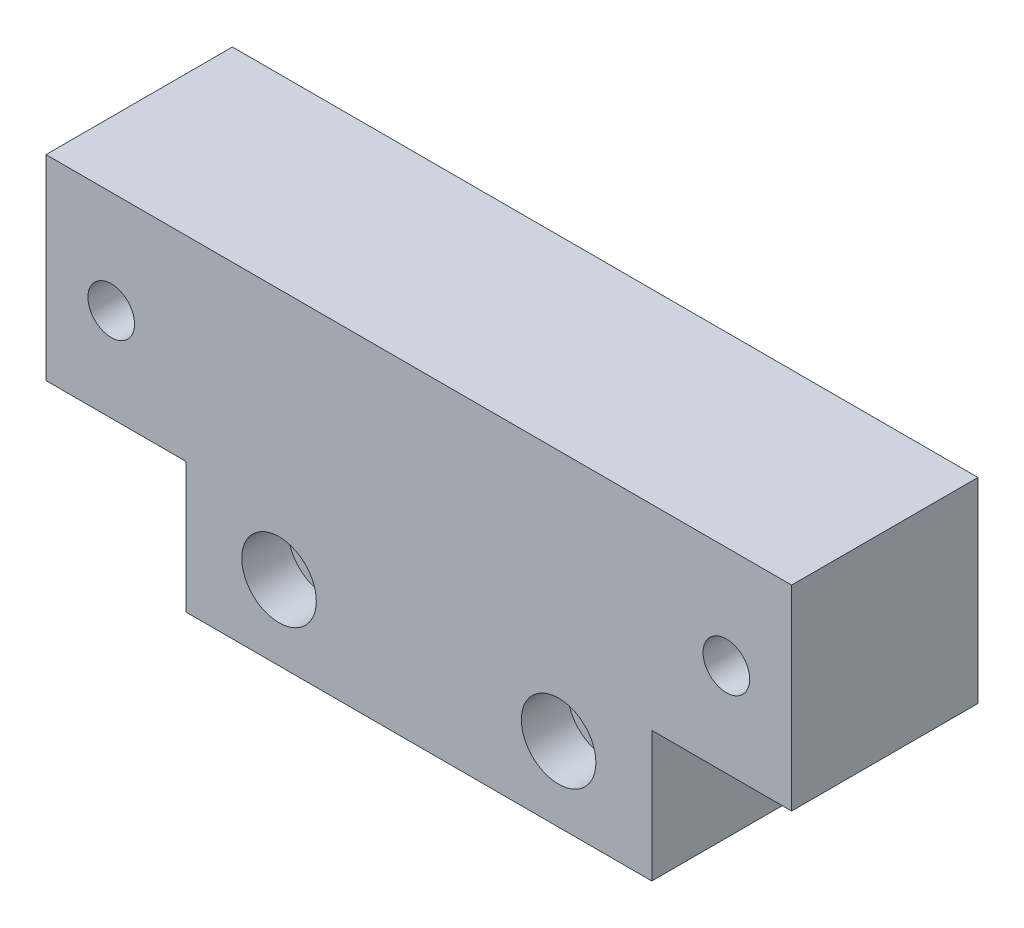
ISO-10303-21;
HEADER;
FILE_DESCRIPTION(('STEP AP214'),'2;1');
FILE_NAME('part.step','',(''),(''),'','','');
FILE_SCHEMA(('AUTOMOTIVE_DESIGN { 1 0 10303 214 1 1 1 1 }'));
ENDSEC;
DATA;
#1=APPLICATION_CONTEXT('core data for automotive mechanical design processes');
#2=APPLICATION_PROTOCOL_DEFINITION('international standard','automotive_design',2000,#1);
#3=PRODUCT_CONTEXT('',#1,'mechanical');
#4=PRODUCT('Part','Part','',(#3));
#5=PRODUCT_RELATED_PRODUCT_CATEGORY('part','',(#4));
#6=PRODUCT_DEFINITION_FORMATION('','',#4);
#7=PRODUCT_DEFINITION_CONTEXT('part definition',#1,'design');
#8=PRODUCT_DEFINITION('design','',#6,#7);
#9=PRODUCT_DEFINITION_SHAPE('','',#8);
#10=(LENGTH_UNIT() NAMED_UNIT(*) SI_UNIT(.MILLI.,.METRE.));
#11=(NAMED_UNIT(*) PLANE_ANGLE_UNIT() SI_UNIT($,.RADIAN.));
#12=(NAMED_UNIT(*) SI_UNIT($,.STERADIAN.) SOLID_ANGLE_UNIT());
#13=UNCERTAINTY_MEASURE_WITH_UNIT(LENGTH_MEASURE(1.E-05),#10,'distance_accuracy_value','');
#14=(GEOMETRIC_REPRESENTATION_CONTEXT(3) GLOBAL_UNCERTAINTY_ASSIGNED_CONTEXT((#13)) GLOBAL_UNIT_ASSIGNED_CONTEXT((#10,
#11,#12)) REPRESENTATION_CONTEXT('',''));
#15=CARTESIAN_POINT('',(0.,0.,0.));
#16=DIRECTION('',(0.,0.,1.));
#17=DIRECTION('',(1.,0.,0.));
#18=AXIS2_PLACEMENT_3D('',#15,#16,#17);
#19=CARTESIAN_POINT('',(40.,-3.49999999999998,20.));
#20=DIRECTION('',(-1.,0.,0.));
#21=DIRECTION('',(0.,0.,1.));
#22=AXIS2_PLACEMENT_3D('',#19,#20,#21);
#23=PLANE('',#22);
#24=DIRECTION('',(0.,1.,0.));
#25=VECTOR('',#24,1.);
#26=CARTESIAN_POINT('',(40.,-3.49999999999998,0.));
#27=LINE('',#26,#25);
#28=CARTESIAN_POINT('',(40.,-3.49999999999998,0.));
#29=VERTEX_POINT('',#28);
#30=CARTESIAN_POINT('',(40.,17.5,0.));
#31=VERTEX_POINT('',#30);
#32=EDGE_CURVE('E141',#29,#31,#27,.T.);
#33=ORIENTED_EDGE('',*,*,#32,.T.);
#34=DIRECTION('',(0.,0.,-1.));
#35=VECTOR('',#34,1.);
#36=CARTESIAN_POINT('',(40.,17.5,20.));
#37=LINE('',#36,#35);
#38=CARTESIAN_POINT('',(40.,17.5,20.));
#39=VERTEX_POINT('',#38);
#40=EDGE_CURVE('E11',#39,#31,#37,.T.);
#41=ORIENTED_EDGE('',*,*,#40,.F.);
#42=DIRECTION('',(0.,1.,0.));
#43=VECTOR('',#42,1.);
#44=CARTESIAN_POINT('',(40.,-3.49999999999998,20.));
#45=LINE('',#44,#43);
#46=CARTESIAN_POINT('',(40.,-3.49999999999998,20.));
#47=VERTEX_POINT('',#46);
#48=EDGE_CURVE('E156',#47,#39,#45,.T.);
#49=ORIENTED_EDGE('',*,*,#48,.F.);
#50=DIRECTION('',(0.,0.,-1.));
#51=VECTOR('',#50,1.);
#52=CARTESIAN_POINT('',(40.,-3.49999999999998,20.));
#53=LINE('',#52,#51);
#54=EDGE_CURVE('E137',#47,#29,#53,.T.);
#55=ORIENTED_EDGE('',*,*,#54,.T.);
#56=EDGE_LOOP('',(#33,#41,#49,#55));
#57=FACE_BOUND('',#56,.T.);
#58=ADVANCED_FACE('F43',(#57),#23,.F.);
#59=CARTESIAN_POINT('',(-40.,17.5,20.));
#60=DIRECTION('',(0.,-1.,0.));
#61=DIRECTION('',(0.,0.,-1.));
#62=AXIS2_PLACEMENT_3D('',#59,#60,#61);
#63=PLANE('',#62);
#64=DIRECTION('',(-1.,0.,0.));
#65=VECTOR('',#64,1.);
#66=CARTESIAN_POINT('',(-40.,17.5,0.));
#67=LINE('',#66,#65);
#68=CARTESIAN_POINT('',(-40.,17.5,0.));
#69=VERTEX_POINT('',#68);
#70=EDGE_CURVE('E144',#31,#69,#67,.T.);
#71=ORIENTED_EDGE('',*,*,#70,.T.);
#72=DIRECTION('',(0.,0.,-1.));
#73=VECTOR('',#72,1.);
#74=CARTESIAN_POINT('',(-40.,17.5,20.));
#75=LINE('',#74,#73);
#76=CARTESIAN_POINT('',(-40.,17.5,20.));
#77=VERTEX_POINT('',#76);
#78=EDGE_CURVE('E52',#77,#69,#75,.T.);
#79=ORIENTED_EDGE('',*,*,#78,.F.);
#80=DIRECTION('',(-1.,0.,0.));
#81=VECTOR('',#80,1.);
#82=CARTESIAN_POINT('',(-40.,17.5,20.));
#83=LINE('',#82,#81);
#84=EDGE_CURVE('E104',#39,#77,#83,.T.);
#85=ORIENTED_EDGE('',*,*,#84,.F.);
#86=ORIENTED_EDGE('',*,*,#40,.T.);
#87=EDGE_LOOP('',(#71,#79,#85,#86));
#88=FACE_BOUND('',#87,.T.);
#89=ADVANCED_FACE('F250',(#88),#63,.F.);
#90=CARTESIAN_POINT('',(-40.,-3.49999999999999,20.));
#91=DIRECTION('',(1.,0.,0.));
#92=DIRECTION('',(0.,0.,-1.));
#93=AXIS2_PLACEMENT_3D('',#90,#91,#92);
#94=PLANE('',#93);
#95=DIRECTION('',(0.,-1.,0.));
#96=VECTOR('',#95,1.);
#97=CARTESIAN_POINT('',(-40.,-3.49999999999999,0.));
#98=LINE('',#97,#96);
#99=CARTESIAN_POINT('',(-40.,-3.49999999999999,0.));
#100=VERTEX_POINT('',#99);
#101=EDGE_CURVE('E147',#69,#100,#98,.T.);
#102=ORIENTED_EDGE('',*,*,#101,.T.);
#103=DIRECTION('',(0.,0.,-1.));
#104=VECTOR('',#103,1.);
#105=CARTESIAN_POINT('',(-40.,-3.49999999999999,20.));
#106=LINE('',#105,#104);
#107=CARTESIAN_POINT('',(-40.,-3.49999999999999,20.));
#108=VERTEX_POINT('',#107);
#109=EDGE_CURVE('E163',#108,#100,#106,.T.);
#110=ORIENTED_EDGE('',*,*,#109,.F.);
#111=DIRECTION('',(0.,-1.,0.));
#112=VECTOR('',#111,1.);
#113=CARTESIAN_POINT('',(-40.,-3.49999999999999,20.));
#114=LINE('',#113,#112);
#115=EDGE_CURVE('E218',#77,#108,#114,.T.);
#116=ORIENTED_EDGE('',*,*,#115,.F.);
#117=ORIENTED_EDGE('',*,*,#78,.T.);
#118=EDGE_LOOP('',(#102,#110,#116,#117));
#119=FACE_BOUND('',#118,.T.);
#120=ADVANCED_FACE('F254',(#119),#94,.F.);
#121=CARTESIAN_POINT('',(-40.,-3.49999999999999,20.));
#122=DIRECTION('',(0.,1.,0.));
#123=DIRECTION('',(0.,0.,1.));
#124=AXIS2_PLACEMENT_3D('',#121,#122,#123);
#125=PLANE('',#124);
#126=DIRECTION('',(1.,0.,0.));
#127=VECTOR('',#126,1.);
#128=CARTESIAN_POINT('',(-40.,-3.49999999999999,0.));
#129=LINE('',#128,#127);
#130=CARTESIAN_POINT('',(-25.,-3.49999999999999,0.));
#131=VERTEX_POINT('',#130);
#132=EDGE_CURVE('E149',#100,#131,#129,.T.);
#133=ORIENTED_EDGE('',*,*,#132,.T.);
#134=DIRECTION('',(0.,0.,-1.));
#135=VECTOR('',#134,1.);
#136=CARTESIAN_POINT('',(-25.,-3.49999999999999,20.));
#137=LINE('',#136,#135);
#138=CARTESIAN_POINT('',(-25.,-3.49999999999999,20.));
#139=VERTEX_POINT('',#138);
#140=EDGE_CURVE('E160',#139,#131,#137,.T.);
#141=ORIENTED_EDGE('',*,*,#140,.F.);
#142=DIRECTION('',(1.,0.,0.));
#143=VECTOR('',#142,1.);
#144=CARTESIAN_POINT('',(-40.,-3.49999999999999,20.));
#145=LINE('',#144,#143);
#146=EDGE_CURVE('E220',#108,#139,#145,.T.);
#147=ORIENTED_EDGE('',*,*,#146,.F.);
#148=ORIENTED_EDGE('',*,*,#109,.T.);
#149=EDGE_LOOP('',(#133,#141,#147,#148));
#150=FACE_BOUND('',#149,.T.);
#151=ADVANCED_FACE('F226',(#150),#125,.F.);
#152=CARTESIAN_POINT('',(-25.,-17.5,20.));
#153=DIRECTION('',(1.,0.,0.));
#154=DIRECTION('',(0.,0.,-1.));
#155=AXIS2_PLACEMENT_3D('',#152,#153,#154);
#156=PLANE('',#155);
#157=DIRECTION('',(0.,-1.,0.));
#158=VECTOR('',#157,1.);
#159=CARTESIAN_POINT('',(-25.,-17.5,0.));
#160=LINE('',#159,#158);
#161=CARTESIAN_POINT('',(-25.,-17.5,0.));
#162=VERTEX_POINT('',#161);
#163=EDGE_CURVE('E151',#131,#162,#160,.T.);
#164=ORIENTED_EDGE('',*,*,#163,.T.);
#165=DIRECTION('',(0.,0.,-1.));
#166=VECTOR('',#165,1.);
#167=CARTESIAN_POINT('',(-25.,-17.5,20.));
#168=LINE('',#167,#166);
#169=CARTESIAN_POINT('',(-25.,-17.5,20.));
#170=VERTEX_POINT('',#169);
#171=EDGE_CURVE('E132',#170,#162,#168,.T.);
#172=ORIENTED_EDGE('',*,*,#171,.F.);
#173=DIRECTION('',(0.,-1.,0.));
#174=VECTOR('',#173,1.);
#175=CARTESIAN_POINT('',(-25.,-17.5,20.));
#176=LINE('',#175,#174);
#177=EDGE_CURVE('E123',#139,#170,#176,.T.);
#178=ORIENTED_EDGE('',*,*,#177,.F.);
#179=ORIENTED_EDGE('',*,*,#140,.T.);
#180=EDGE_LOOP('',(#164,#172,#178,#179));
#181=FACE_BOUND('',#180,.T.);
#182=ADVANCED_FACE('F230',(#181),#156,.F.);
#183=CARTESIAN_POINT('',(-25.,-17.5,20.));
#184=DIRECTION('',(0.,1.,0.));
#185=DIRECTION('',(0.,0.,1.));
#186=AXIS2_PLACEMENT_3D('',#183,#184,#185);
#187=PLANE('',#186);
#188=DIRECTION('',(1.,0.,0.));
#189=VECTOR('',#188,1.);
#190=CARTESIAN_POINT('',(-25.,-17.5,0.));
#191=LINE('',#190,#189);
#192=CARTESIAN_POINT('',(25.,-17.5,0.));
#193=VERTEX_POINT('',#192);
#194=EDGE_CURVE('E131',#162,#193,#191,.T.);
#195=ORIENTED_EDGE('',*,*,#194,.T.);
#196=DIRECTION('',(0.,0.,-1.));
#197=VECTOR('',#196,1.);
#198=CARTESIAN_POINT('',(25.,-17.5,20.));
#199=LINE('',#198,#197);
#200=CARTESIAN_POINT('',(25.,-17.5,20.));
#201=VERTEX_POINT('',#200);
#202=EDGE_CURVE('E128',#201,#193,#199,.T.);
#203=ORIENTED_EDGE('',*,*,#202,.F.);
#204=DIRECTION('',(1.,0.,0.));
#205=VECTOR('',#204,1.);
#206=CARTESIAN_POINT('',(-25.,-17.5,20.));
#207=LINE('',#206,#205);
#208=EDGE_CURVE('E117',#170,#201,#207,.T.);
#209=ORIENTED_EDGE('',*,*,#208,.F.);
#210=ORIENTED_EDGE('',*,*,#171,.T.);
#211=EDGE_LOOP('',(#195,#203,#209,#210));
#212=FACE_BOUND('',#211,.T.);
#213=ADVANCED_FACE('F129',(#212),#187,.F.);
#214=CARTESIAN_POINT('',(25.,-17.5,20.));
#215=DIRECTION('',(-1.,0.,0.));
#216=DIRECTION('',(0.,0.,1.));
#217=AXIS2_PLACEMENT_3D('',#214,#215,#216);
#218=PLANE('',#217);
#219=DIRECTION('',(0.,1.,0.));
#220=VECTOR('',#219,1.);
#221=CARTESIAN_POINT('',(25.,-17.5,0.));
#222=LINE('',#221,#220);
#223=CARTESIAN_POINT('',(25.,-3.49999999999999,0.));
#224=VERTEX_POINT('',#223);
#225=EDGE_CURVE('E90',#193,#224,#222,.T.);
#226=ORIENTED_EDGE('',*,*,#225,.T.);
#227=DIRECTION('',(0.,0.,-1.));
#228=VECTOR('',#227,1.);
#229=CARTESIAN_POINT('',(25.,-3.49999999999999,20.));
#230=LINE('',#229,#228);
#231=CARTESIAN_POINT('',(25.,-3.49999999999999,20.));
#232=VERTEX_POINT('',#231);
#233=EDGE_CURVE('E133',#232,#224,#230,.T.);
#234=ORIENTED_EDGE('',*,*,#233,.F.);
#235=DIRECTION('',(0.,1.,0.));
#236=VECTOR('',#235,1.);
#237=CARTESIAN_POINT('',(25.,-17.5,20.));
#238=LINE('',#237,#236);
#239=EDGE_CURVE('E121',#201,#232,#238,.T.);
#240=ORIENTED_EDGE('',*,*,#239,.F.);
#241=ORIENTED_EDGE('',*,*,#202,.T.);
#242=EDGE_LOOP('',(#226,#234,#240,#241));
#243=FACE_BOUND('',#242,.T.);
#244=ADVANCED_FACE('F135',(#243),#218,.F.);
#245=CARTESIAN_POINT('',(25.,-3.49999999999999,20.));
#246=DIRECTION('',(0.,1.,0.));
#247=DIRECTION('',(-1.,0.,0.));
#248=AXIS2_PLACEMENT_3D('',#245,#246,#247);
#249=PLANE('',#248);
#250=DIRECTION('',(1.,0.,0.));
#251=VECTOR('',#250,1.);
#252=CARTESIAN_POINT('',(25.,-3.49999999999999,0.));
#253=LINE('',#252,#251);
#254=EDGE_CURVE('E96',#224,#29,#253,.T.);
#255=ORIENTED_EDGE('',*,*,#254,.T.);
#256=ORIENTED_EDGE('',*,*,#54,.F.);
#257=DIRECTION('',(1.,0.,0.));
#258=VECTOR('',#257,1.);
#259=CARTESIAN_POINT('',(25.,-3.49999999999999,20.));
#260=LINE('',#259,#258);
#261=EDGE_CURVE('E61',#232,#47,#260,.T.);
#262=ORIENTED_EDGE('',*,*,#261,.F.);
#263=ORIENTED_EDGE('',*,*,#233,.T.);
#264=EDGE_LOOP('',(#255,#256,#262,#263));
#265=FACE_BOUND('',#264,.T.);
#266=ADVANCED_FACE('F238',(#265),#249,.F.);
#267=CARTESIAN_POINT('',(0.,0.,20.));
#268=DIRECTION('',(0.,0.,-1.));
#269=DIRECTION('',(-1.,0.,0.));
#270=AXIS2_PLACEMENT_3D('',#267,#268,#269);
#271=PLANE('',#270);
#272=CARTESIAN_POINT('',(33.,6.50000000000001,20.));
#273=DIRECTION('',(0.,0.,-1.));
#274=DIRECTION('',(-1.,0.,0.));
#275=AXIS2_PLACEMENT_3D('',#272,#273,#274);
#276=CIRCLE('',#275,2.5);
#277=CARTESIAN_POINT('',(30.5,6.50000000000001,20.));
#278=VERTEX_POINT('',#277);
#279=EDGE_CURVE('E177',#278,#278,#276,.T.);
#280=ORIENTED_EDGE('',*,*,#279,.T.);
#281=EDGE_LOOP('',(#280));
#282=FACE_BOUND('',#281,.T.);
#283=CARTESIAN_POINT('',(-33.,6.50000000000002,20.));
#284=DIRECTION('',(0.,0.,-1.));
#285=DIRECTION('',(-1.,0.,0.));
#286=AXIS2_PLACEMENT_3D('',#283,#284,#285);
#287=CIRCLE('',#286,2.5);
#288=CARTESIAN_POINT('',(-35.5,6.50000000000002,20.));
#289=VERTEX_POINT('',#288);
#290=EDGE_CURVE('E183',#289,#289,#287,.T.);
#291=ORIENTED_EDGE('',*,*,#290,.T.);
#292=EDGE_LOOP('',(#291));
#293=FACE_BOUND('',#292,.T.);
#294=CARTESIAN_POINT('',(-15.,-9.49999999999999,20.));
#295=DIRECTION('',(0.,0.,1.));
#296=DIRECTION('',(1.,0.,0.));
#297=AXIS2_PLACEMENT_3D('',#294,#295,#296);
#298=CIRCLE('',#297,4.);
#299=CARTESIAN_POINT('',(-11.,-9.49999999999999,20.));
#300=VERTEX_POINT('',#299);
#301=EDGE_CURVE('E208',#300,#300,#298,.T.);
#302=ORIENTED_EDGE('',*,*,#301,.F.);
#303=EDGE_LOOP('',(#302));
#304=FACE_BOUND('',#303,.T.);
#305=CARTESIAN_POINT('',(15.,-9.5,20.));
#306=DIRECTION('',(0.,0.,1.));
#307=DIRECTION('',(1.,0.,0.));
#308=AXIS2_PLACEMENT_3D('',#305,#306,#307);
#309=CIRCLE('',#308,4.);
#310=CARTESIAN_POINT('',(19.,-9.5,20.));
#311=VERTEX_POINT('',#310);
#312=EDGE_CURVE('E145',#311,#311,#309,.T.);
#313=ORIENTED_EDGE('',*,*,#312,.F.);
#314=EDGE_LOOP('',(#313));
#315=FACE_BOUND('',#314,.T.);
#316=ORIENTED_EDGE('',*,*,#48,.T.);
#317=ORIENTED_EDGE('',*,*,#84,.T.);
#318=ORIENTED_EDGE('',*,*,#115,.T.);
#319=ORIENTED_EDGE('',*,*,#146,.T.);
#320=ORIENTED_EDGE('',*,*,#177,.T.);
#321=ORIENTED_EDGE('',*,*,#208,.T.);
#322=ORIENTED_EDGE('',*,*,#239,.T.);
#323=ORIENTED_EDGE('',*,*,#261,.T.);
#324=EDGE_LOOP('',(#316,#317,#318,#319,#320,#321,#322,#323));
#325=FACE_BOUND('',#324,.T.);
#326=ADVANCED_FACE('F119',(#282,#293,#304,#315,#325),#271,.F.);
#327=CARTESIAN_POINT('',(0.,0.,0.));
#328=DIRECTION('',(0.,0.,-1.));
#329=DIRECTION('',(-1.,0.,0.));
#330=AXIS2_PLACEMENT_3D('',#327,#328,#329);
#331=PLANE('',#330);
#332=CARTESIAN_POINT('',(33.,6.50000000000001,0.));
#333=DIRECTION('',(0.,0.,-1.));
#334=DIRECTION('',(-1.,0.,0.));
#335=AXIS2_PLACEMENT_3D('',#332,#333,#334);
#336=CIRCLE('',#335,5.);
#337=CARTESIAN_POINT('',(28.,6.50000000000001,0.));
#338=VERTEX_POINT('',#337);
#339=EDGE_CURVE('E192',#338,#338,#336,.T.);
#340=ORIENTED_EDGE('',*,*,#339,.F.);
#341=EDGE_LOOP('',(#340));
#342=FACE_BOUND('',#341,.T.);
#343=CARTESIAN_POINT('',(-33.,6.50000000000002,0.));
#344=DIRECTION('',(0.,0.,-1.));
#345=DIRECTION('',(-1.,0.,0.));
#346=AXIS2_PLACEMENT_3D('',#343,#344,#345);
#347=CIRCLE('',#346,5.);
#348=CARTESIAN_POINT('',(-38.,6.50000000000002,0.));
#349=VERTEX_POINT('',#348);
#350=EDGE_CURVE('E198',#349,#349,#347,.T.);
#351=ORIENTED_EDGE('',*,*,#350,.F.);
#352=EDGE_LOOP('',(#351));
#353=FACE_BOUND('',#352,.T.);
#354=CARTESIAN_POINT('',(-15.,-9.49999999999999,0.));
#355=DIRECTION('',(0.,0.,1.));
#356=DIRECTION('',(1.,0.,0.));
#357=AXIS2_PLACEMENT_3D('',#354,#355,#356);
#358=CIRCLE('',#357,2.5);
#359=CARTESIAN_POINT('',(-12.5,-9.49999999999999,0.));
#360=VERTEX_POINT('',#359);
#361=EDGE_CURVE('E172',#360,#360,#358,.T.);
#362=ORIENTED_EDGE('',*,*,#361,.T.);
#363=EDGE_LOOP('',(#362));
#364=FACE_BOUND('',#363,.T.);
#365=CARTESIAN_POINT('',(15.,-9.5,0.));
#366=DIRECTION('',(0.,0.,1.));
#367=DIRECTION('',(1.,0.,0.));
#368=AXIS2_PLACEMENT_3D('',#365,#366,#367);
#369=CIRCLE('',#368,2.5);
#370=CARTESIAN_POINT('',(17.5,-9.5,0.));
#371=VERTEX_POINT('',#370);
#372=EDGE_CURVE('E201',#371,#371,#369,.T.);
#373=ORIENTED_EDGE('',*,*,#372,.T.);
#374=EDGE_LOOP('',(#373));
#375=FACE_BOUND('',#374,.T.);
#376=ORIENTED_EDGE('',*,*,#32,.F.);
#377=ORIENTED_EDGE('',*,*,#254,.F.);
#378=ORIENTED_EDGE('',*,*,#225,.F.);
#379=ORIENTED_EDGE('',*,*,#194,.F.);
#380=ORIENTED_EDGE('',*,*,#163,.F.);
#381=ORIENTED_EDGE('',*,*,#132,.F.);
#382=ORIENTED_EDGE('',*,*,#101,.F.);
#383=ORIENTED_EDGE('',*,*,#70,.F.);
#384=EDGE_LOOP('',(#376,#377,#378,#379,#380,#381,#382,#383));
#385=FACE_BOUND('',#384,.T.);
#386=ADVANCED_FACE('F233',(#342,#353,#364,#375,#385),#331,.T.);
#387=CARTESIAN_POINT('',(15.,-9.5,20.));
#388=DIRECTION('',(0.,0.,1.));
#389=DIRECTION('',(1.,0.,0.));
#390=AXIS2_PLACEMENT_3D('',#387,#388,#389);
#391=CYLINDRICAL_SURFACE('',#390,4.);
#392=CARTESIAN_POINT('',(15.,-9.5,15.));
#393=DIRECTION('',(0.,0.,1.));
#394=DIRECTION('',(1.,0.,0.));
#395=AXIS2_PLACEMENT_3D('',#392,#393,#394);
#396=CIRCLE('',#395,4.);
#397=CARTESIAN_POINT('',(19.,-9.5,15.));
#398=VERTEX_POINT('',#397);
#399=EDGE_CURVE('E211',#398,#398,#396,.T.);
#400=ORIENTED_EDGE('',*,*,#399,.F.);
#401=EDGE_LOOP('',(#400));
#402=FACE_BOUND('',#401,.T.);
#403=ORIENTED_EDGE('',*,*,#312,.T.);
#404=EDGE_LOOP('',(#403));
#405=FACE_BOUND('',#404,.T.);
#406=ADVANCED_FACE('F297',(#402,#405),#391,.F.);
#407=CARTESIAN_POINT('',(19.,-9.5,15.));
#408=DIRECTION('',(0.,0.,-1.));
#409=DIRECTION('',(-1.,0.,0.));
#410=AXIS2_PLACEMENT_3D('',#407,#408,#409);
#411=PLANE('',#410);
#412=CARTESIAN_POINT('',(15.,-9.5,15.));
#413=DIRECTION('',(0.,0.,-1.));
#414=DIRECTION('',(-1.,0.,0.));
#415=AXIS2_PLACEMENT_3D('',#412,#413,#414);
#416=CIRCLE('',#415,2.5);
#417=CARTESIAN_POINT('',(12.5,-9.5,15.));
#418=VERTEX_POINT('',#417);
#419=EDGE_CURVE('E171',#418,#418,#416,.T.);
#420=ORIENTED_EDGE('',*,*,#419,.T.);
#421=EDGE_LOOP('',(#420));
#422=FACE_BOUND('',#421,.T.);
#423=ORIENTED_EDGE('',*,*,#399,.T.);
#424=EDGE_LOOP('',(#423));
#425=FACE_BOUND('',#424,.T.);
#426=ADVANCED_FACE('F307',(#422,#425),#411,.F.);
#427=CARTESIAN_POINT('',(-15.,-9.49999999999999,20.));
#428=DIRECTION('',(0.,0.,1.));
#429=DIRECTION('',(1.,0.,0.));
#430=AXIS2_PLACEMENT_3D('',#427,#428,#429);
#431=CYLINDRICAL_SURFACE('',#430,4.);
#432=CARTESIAN_POINT('',(-15.,-9.49999999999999,15.));
#433=DIRECTION('',(0.,0.,1.));
#434=DIRECTION('',(1.,0.,0.));
#435=AXIS2_PLACEMENT_3D('',#432,#433,#434);
#436=CIRCLE('',#435,4.);
#437=CARTESIAN_POINT('',(-11.,-9.49999999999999,15.));
#438=VERTEX_POINT('',#437);
#439=EDGE_CURVE('E174',#438,#438,#436,.T.);
#440=ORIENTED_EDGE('',*,*,#439,.F.);
#441=EDGE_LOOP('',(#440));
#442=FACE_BOUND('',#441,.T.);
#443=ORIENTED_EDGE('',*,*,#301,.T.);
#444=EDGE_LOOP('',(#443));
#445=FACE_BOUND('',#444,.T.);
#446=ADVANCED_FACE('F318',(#442,#445),#431,.F.);
#447=CARTESIAN_POINT('',(-11.,-9.49999999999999,15.));
#448=DIRECTION('',(0.,0.,-1.));
#449=DIRECTION('',(-1.,0.,0.));
#450=AXIS2_PLACEMENT_3D('',#447,#448,#449);
#451=PLANE('',#450);
#452=CARTESIAN_POINT('',(-15.,-9.49999999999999,15.));
#453=DIRECTION('',(0.,0.,-1.));
#454=DIRECTION('',(-1.,0.,0.));
#455=AXIS2_PLACEMENT_3D('',#452,#453,#454);
#456=CIRCLE('',#455,2.5);
#457=CARTESIAN_POINT('',(-17.5,-9.49999999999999,15.));
#458=VERTEX_POINT('',#457);
#459=EDGE_CURVE('E168',#458,#458,#456,.T.);
#460=ORIENTED_EDGE('',*,*,#459,.T.);
#461=EDGE_LOOP('',(#460));
#462=FACE_BOUND('',#461,.T.);
#463=ORIENTED_EDGE('',*,*,#439,.T.);
#464=EDGE_LOOP('',(#463));
#465=FACE_BOUND('',#464,.T.);
#466=ADVANCED_FACE('F328',(#462,#465),#451,.F.);
#467=CARTESIAN_POINT('',(-15.,-9.49999999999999,0.));
#468=DIRECTION('',(0.,0.,1.));
#469=DIRECTION('',(1.,0.,0.));
#470=AXIS2_PLACEMENT_3D('',#467,#468,#469);
#471=CYLINDRICAL_SURFACE('',#470,2.5);
#472=ORIENTED_EDGE('',*,*,#361,.F.);
#473=EDGE_LOOP('',(#472));
#474=FACE_BOUND('',#473,.T.);
#475=ORIENTED_EDGE('',*,*,#459,.F.);
#476=EDGE_LOOP('',(#475));
#477=FACE_BOUND('',#476,.T.);
#478=ADVANCED_FACE('F337',(#474,#477),#471,.F.);
#479=CARTESIAN_POINT('',(15.,-9.5,0.));
#480=DIRECTION('',(0.,0.,1.));
#481=DIRECTION('',(1.,0.,0.));
#482=AXIS2_PLACEMENT_3D('',#479,#480,#481);
#483=CYLINDRICAL_SURFACE('',#482,2.5);
#484=ORIENTED_EDGE('',*,*,#372,.F.);
#485=EDGE_LOOP('',(#484));
#486=FACE_BOUND('',#485,.T.);
#487=ORIENTED_EDGE('',*,*,#419,.F.);
#488=EDGE_LOOP('',(#487));
#489=FACE_BOUND('',#488,.T.);
#490=ADVANCED_FACE('F347',(#486,#489),#483,.F.);
#491=CARTESIAN_POINT('',(-33.,6.50000000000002,0.));
#492=DIRECTION('',(0.,0.,-1.));
#493=DIRECTION('',(-1.,0.,0.));
#494=AXIS2_PLACEMENT_3D('',#491,#492,#493);
#495=CYLINDRICAL_SURFACE('',#494,5.);
#496=CARTESIAN_POINT('',(-33.,6.50000000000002,11.));
#497=DIRECTION('',(0.,0.,-1.));
#498=DIRECTION('',(-1.,0.,0.));
#499=AXIS2_PLACEMENT_3D('',#496,#497,#498);
#500=CIRCLE('',#499,5.);
#501=CARTESIAN_POINT('',(-38.,6.50000000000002,11.));
#502=VERTEX_POINT('',#501);
#503=EDGE_CURVE('E195',#502,#502,#500,.T.);
#504=ORIENTED_EDGE('',*,*,#503,.F.);
#505=EDGE_LOOP('',(#504));
#506=FACE_BOUND('',#505,.T.);
#507=ORIENTED_EDGE('',*,*,#350,.T.);
#508=EDGE_LOOP('',(#507));
#509=FACE_BOUND('',#508,.T.);
#510=ADVANCED_FACE('F356',(#506,#509),#495,.F.);
#511=CARTESIAN_POINT('',(-28.,6.50000000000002,11.));
#512=DIRECTION('',(0.,0.,1.));
#513=DIRECTION('',(1.,0.,0.));
#514=AXIS2_PLACEMENT_3D('',#511,#512,#513);
#515=PLANE('',#514);
#516=CARTESIAN_POINT('',(-33.,6.50000000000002,11.));
#517=DIRECTION('',(0.,0.,1.));
#518=DIRECTION('',(1.,0.,0.));
#519=AXIS2_PLACEMENT_3D('',#516,#517,#518);
#520=CIRCLE('',#519,2.5);
#521=CARTESIAN_POINT('',(-30.5,6.50000000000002,11.));
#522=VERTEX_POINT('',#521);
#523=EDGE_CURVE('E46',#522,#522,#520,.T.);
#524=ORIENTED_EDGE('',*,*,#523,.T.);
#525=EDGE_LOOP('',(#524));
#526=FACE_BOUND('',#525,.T.);
#527=ORIENTED_EDGE('',*,*,#503,.T.);
#528=EDGE_LOOP('',(#527));
#529=FACE_BOUND('',#528,.T.);
#530=ADVANCED_FACE('F365',(#526,#529),#515,.F.);
#531=CARTESIAN_POINT('',(33.,6.50000000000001,0.));
#532=DIRECTION('',(0.,0.,-1.));
#533=DIRECTION('',(-1.,0.,0.));
#534=AXIS2_PLACEMENT_3D('',#531,#532,#533);
#535=CYLINDRICAL_SURFACE('',#534,5.);
#536=CARTESIAN_POINT('',(33.,6.50000000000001,11.));
#537=DIRECTION('',(0.,0.,-1.));
#538=DIRECTION('',(-1.,0.,0.));
#539=AXIS2_PLACEMENT_3D('',#536,#537,#538);
#540=CIRCLE('',#539,5.);
#541=CARTESIAN_POINT('',(28.,6.50000000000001,11.));
#542=VERTEX_POINT('',#541);
#543=EDGE_CURVE('E181',#542,#542,#540,.T.);
#544=ORIENTED_EDGE('',*,*,#543,.F.);
#545=EDGE_LOOP('',(#544));
#546=FACE_BOUND('',#545,.T.);
#547=ORIENTED_EDGE('',*,*,#339,.T.);
#548=EDGE_LOOP('',(#547));
#549=FACE_BOUND('',#548,.T.);
#550=ADVANCED_FACE('F374',(#546,#549),#535,.F.);
#551=CARTESIAN_POINT('',(38.,6.50000000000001,11.));
#552=DIRECTION('',(0.,0.,1.));
#553=DIRECTION('',(1.,0.,0.));
#554=AXIS2_PLACEMENT_3D('',#551,#552,#553);
#555=PLANE('',#554);
#556=CARTESIAN_POINT('',(33.,6.50000000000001,11.));
#557=DIRECTION('',(0.,0.,1.));
#558=DIRECTION('',(1.,0.,0.));
#559=AXIS2_PLACEMENT_3D('',#556,#557,#558);
#560=CIRCLE('',#559,2.5);
#561=CARTESIAN_POINT('',(35.5,6.50000000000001,11.));
#562=VERTEX_POINT('',#561);
#563=EDGE_CURVE('E175',#562,#562,#560,.T.);
#564=ORIENTED_EDGE('',*,*,#563,.T.);
#565=EDGE_LOOP('',(#564));
#566=FACE_BOUND('',#565,.T.);
#567=ORIENTED_EDGE('',*,*,#543,.T.);
#568=EDGE_LOOP('',(#567));
#569=FACE_BOUND('',#568,.T.);
#570=ADVANCED_FACE('F384',(#566,#569),#555,.F.);
#571=CARTESIAN_POINT('',(33.,6.50000000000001,20.));
#572=DIRECTION('',(0.,0.,-1.));
#573=DIRECTION('',(-1.,0.,0.));
#574=AXIS2_PLACEMENT_3D('',#571,#572,#573);
#575=CYLINDRICAL_SURFACE('',#574,2.5);
#576=ORIENTED_EDGE('',*,*,#279,.F.);
#577=EDGE_LOOP('',(#576));
#578=FACE_BOUND('',#577,.T.);
#579=ORIENTED_EDGE('',*,*,#563,.F.);
#580=EDGE_LOOP('',(#579));
#581=FACE_BOUND('',#580,.T.);
#582=ADVANCED_FACE('F393',(#578,#581),#575,.F.);
#583=CARTESIAN_POINT('',(-33.,6.50000000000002,20.));
#584=DIRECTION('',(0.,0.,-1.));
#585=DIRECTION('',(-1.,0.,0.));
#586=AXIS2_PLACEMENT_3D('',#583,#584,#585);
#587=CYLINDRICAL_SURFACE('',#586,2.5);
#588=ORIENTED_EDGE('',*,*,#290,.F.);
#589=EDGE_LOOP('',(#588));
#590=FACE_BOUND('',#589,.T.);
#591=ORIENTED_EDGE('',*,*,#523,.F.);
#592=EDGE_LOOP('',(#591));
#593=FACE_BOUND('',#592,.T.);
#594=ADVANCED_FACE('F402',(#590,#593),#587,.F.);
#595=CLOSED_SHELL('',(#58,#89,#120,#151,#182,#213,#244,#266,#326,#386,#406,#426,#446,#466,#478,
#490,#510,#530,#550,#570,#582,#594));
#596=MANIFOLD_SOLID_BREP('B2',#595);
#597=ADVANCED_BREP_SHAPE_REPRESENTATION('',(#18,#596),#14);
#598=SHAPE_DEFINITION_REPRESENTATION(#9,#597);
ENDSEC;
END-ISO-10303-21;
